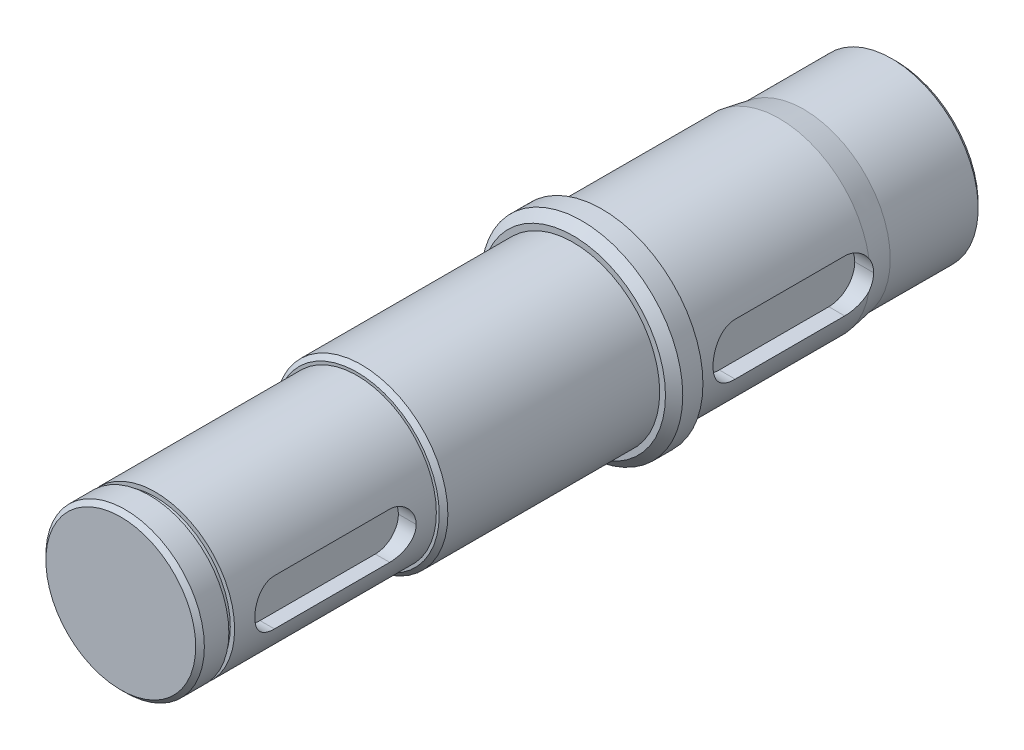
ISO-10303-21;
HEADER;
FILE_DESCRIPTION(('STEP AP214'),'2;1');
FILE_NAME('part.step','',(''),(''),'','','');
FILE_SCHEMA(('AUTOMOTIVE_DESIGN { 1 0 10303 214 1 1 1 1 }'));
ENDSEC;
DATA;
#1=APPLICATION_CONTEXT('core data for automotive mechanical design processes');
#2=APPLICATION_PROTOCOL_DEFINITION('international standard','automotive_design',2000,#1);
#3=PRODUCT_CONTEXT('',#1,'mechanical');
#4=PRODUCT('Part','Part','',(#3));
#5=PRODUCT_RELATED_PRODUCT_CATEGORY('part','',(#4));
#6=PRODUCT_DEFINITION_FORMATION('','',#4);
#7=PRODUCT_DEFINITION_CONTEXT('part definition',#1,'design');
#8=PRODUCT_DEFINITION('design','',#6,#7);
#9=PRODUCT_DEFINITION_SHAPE('','',#8);
#10=(LENGTH_UNIT() NAMED_UNIT(*) SI_UNIT(.MILLI.,.METRE.));
#11=(NAMED_UNIT(*) PLANE_ANGLE_UNIT() SI_UNIT($,.RADIAN.));
#12=(NAMED_UNIT(*) SI_UNIT($,.STERADIAN.) SOLID_ANGLE_UNIT());
#13=UNCERTAINTY_MEASURE_WITH_UNIT(LENGTH_MEASURE(1.E-05),#10,'distance_accuracy_value','');
#14=(GEOMETRIC_REPRESENTATION_CONTEXT(3) GLOBAL_UNCERTAINTY_ASSIGNED_CONTEXT((#13)) GLOBAL_UNIT_ASSIGNED_CONTEXT((#10,
#11,#12)) REPRESENTATION_CONTEXT('',''));
#15=CARTESIAN_POINT('',(0.,0.,0.));
#16=DIRECTION('',(0.,0.,1.));
#17=DIRECTION('',(1.,0.,0.));
#18=AXIS2_PLACEMENT_3D('',#15,#16,#17);
#19=CARTESIAN_POINT('',(0.,0.,23.));
#20=DIRECTION('',(0.,0.,-1.));
#21=DIRECTION('',(-1.,0.,0.));
#22=AXIS2_PLACEMENT_3D('',#19,#20,#21);
#23=CYLINDRICAL_SURFACE('',#22,30.);
#24=CARTESIAN_POINT('',(0.,0.,-7.50000000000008));
#25=DIRECTION('',(0.,0.,-1.));
#26=DIRECTION('',(-1.,0.,0.));
#27=AXIS2_PLACEMENT_3D('',#24,#25,#26);
#28=CIRCLE('',#27,30.);
#29=CARTESIAN_POINT('',(-30.,0.,-7.50000000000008));
#30=VERTEX_POINT('',#29);
#31=EDGE_CURVE('E325',#30,#30,#28,.F.);
#32=ORIENTED_EDGE('',*,*,#31,.T.);
#33=EDGE_LOOP('',(#32));
#34=FACE_BOUND('',#33,.T.);
#35=CARTESIAN_POINT('',(0.,0.,23.));
#36=DIRECTION('',(0.,0.,1.));
#37=DIRECTION('',(1.,0.,0.));
#38=AXIS2_PLACEMENT_3D('',#35,#36,#37);
#39=CIRCLE('',#38,30.);
#40=CARTESIAN_POINT('',(30.,0.,23.));
#41=VERTEX_POINT('',#40);
#42=EDGE_CURVE('E328',#41,#41,#39,.T.);
#43=ORIENTED_EDGE('',*,*,#42,.F.);
#44=EDGE_LOOP('',(#43));
#45=FACE_BOUND('',#44,.T.);
#46=ADVANCED_FACE('F35',(#34,#45),#23,.T.);
#47=CARTESIAN_POINT('',(0.,0.,93.));
#48=DIRECTION('',(0.,0.,-1.));
#49=DIRECTION('',(-1.,0.,0.));
#50=AXIS2_PLACEMENT_3D('',#47,#48,#49);
#51=CYLINDRICAL_SURFACE('',#50,31.5);
#52=CARTESIAN_POINT('',(0.,0.,31.506922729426));
#53=DIRECTION('',(0.,0.,1.));
#54=DIRECTION('',(1.,0.,0.));
#55=AXIS2_PLACEMENT_3D('',#52,#53,#54);
#56=CIRCLE('',#55,31.5);
#57=CARTESIAN_POINT('',(31.1029935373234,4.9853578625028,31.506922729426));
#58=VERTEX_POINT('',#57);
#59=CARTESIAN_POINT('',(31.1029935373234,-4.9853578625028,31.506922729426));
#60=VERTEX_POINT('',#59);
#61=EDGE_CURVE('E50',#58,#60,#56,.T.);
#62=ORIENTED_EDGE('',*,*,#61,.T.);
#63=CARTESIAN_POINT('',(31.1029935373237,-4.98535786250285,31.506922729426));
#64=CARTESIAN_POINT('',(31.068974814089,-5.19766165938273,31.6481512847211));
#65=CARTESIAN_POINT('',(31.0336953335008,-5.40379025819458,31.7983322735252));
#66=CARTESIAN_POINT('',(30.9616349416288,-5.80241445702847,32.1154696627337));
#67=CARTESIAN_POINT('',(30.9248541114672,-5.99491079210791,32.2824251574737));
#68=CARTESIAN_POINT('',(30.8507954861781,-6.36506966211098,32.6320529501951));
#69=CARTESIAN_POINT('',(30.8135175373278,-6.54272747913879,32.8147302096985));
#70=CARTESIAN_POINT('',(30.7395279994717,-6.88197308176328,33.1945477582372));
#71=CARTESIAN_POINT('',(30.7028164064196,-7.04356098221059,33.3916879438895));
#72=CARTESIAN_POINT('',(30.6309810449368,-7.34967667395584,33.7993014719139));
#73=CARTESIAN_POINT('',(30.5958584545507,-7.49419193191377,34.0097844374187));
#74=CARTESIAN_POINT('',(30.5282402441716,-7.7650530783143,34.4426796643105));
#75=CARTESIAN_POINT('',(30.495745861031,-7.89139043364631,34.665097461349));
#76=CARTESIAN_POINT('',(30.4344125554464,-8.1247200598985,35.1200255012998));
#77=CARTESIAN_POINT('',(30.405569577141,-8.23173385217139,35.3525241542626));
#78=CARTESIAN_POINT('',(30.352400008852,-8.42567086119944,35.8261220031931));
#79=CARTESIAN_POINT('',(30.3280709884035,-8.51260489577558,36.06721648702));
#80=CARTESIAN_POINT('',(30.2871855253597,-8.656866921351,36.528145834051));
#81=CARTESIAN_POINT('',(30.2700562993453,-8.71645294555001,36.7472262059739));
#82=CARTESIAN_POINT('',(30.2403547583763,-8.81894421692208,37.1895427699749));
#83=CARTESIAN_POINT('',(30.2277819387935,-8.8618513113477,37.4127784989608));
#84=CARTESIAN_POINT('',(30.2075023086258,-8.93074316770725,37.8625964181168));
#85=CARTESIAN_POINT('',(30.1998068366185,-8.95668850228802,38.0891851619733));
#86=CARTESIAN_POINT('',(30.189501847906,-8.99133079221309,38.5438461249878));
#87=CARTESIAN_POINT('',(30.1868935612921,-9.00002357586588,38.7719186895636));
#88=CARTESIAN_POINT('',(30.1869176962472,-9.,39.));
#89=B_SPLINE_CURVE_WITH_KNOTS('',3,(#63,#64,#65,#66,#67,#68,#69,#70,#71,#72,#73,#74,#75,#76,#77,
#78,#79,#80,#81,#82,#83,#84,#85,#86,#87,#88),.UNSPECIFIED.,.F.,.F.,(4,2,2,2,2,2,2,2,2,2,2,2,4),
(0.,0.771487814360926,1.54293399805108,2.31462453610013,3.08630955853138,3.8585576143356,
4.63116700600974,5.40291053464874,6.17423731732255,6.85661678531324,7.5389206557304,
8.22280494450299,8.90685457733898),.UNSPECIFIED.);
#90=CARTESIAN_POINT('',(30.1869176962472,-9.,39.));
#91=VERTEX_POINT('',#90);
#92=EDGE_CURVE('E644',#60,#91,#89,.T.);
#93=ORIENTED_EDGE('',*,*,#92,.T.);
#94=DIRECTION('',(0.,0.,-1.));
#95=VECTOR('',#94,1.);
#96=CARTESIAN_POINT('',(30.1869176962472,-9.,93.));
#97=LINE('',#96,#95);
#98=CARTESIAN_POINT('',(30.1869176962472,-9.,77.));
#99=VERTEX_POINT('',#98);
#100=EDGE_CURVE('E156',#91,#99,#97,.F.);
#101=ORIENTED_EDGE('',*,*,#100,.T.);
#102=CARTESIAN_POINT('',(30.1869176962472,-9.,77.));
#103=CARTESIAN_POINT('',(30.1868842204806,-9.00003288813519,77.2475868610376));
#104=CARTESIAN_POINT('',(30.1899625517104,-8.98978494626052,77.495161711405));
#105=CARTESIAN_POINT('',(30.2020986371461,-8.94897045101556,77.9884335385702));
#106=CARTESIAN_POINT('',(30.2111551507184,-8.91840811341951,78.234130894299));
#107=CARTESIAN_POINT('',(30.234974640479,-8.83730628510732,78.7213058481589));
#108=CARTESIAN_POINT('',(30.2497237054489,-8.78681548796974,78.9627922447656));
#109=CARTESIAN_POINT('',(30.2844699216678,-8.66630463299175,79.4404563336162));
#110=CARTESIAN_POINT('',(30.3044671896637,-8.59628414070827,79.6766339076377));
#111=CARTESIAN_POINT('',(30.3491057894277,-8.43733217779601,80.1419496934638));
#112=CARTESIAN_POINT('',(30.3737448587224,-8.34840991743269,80.3710912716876));
#113=CARTESIAN_POINT('',(30.4269683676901,-8.15229525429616,80.821038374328));
#114=CARTESIAN_POINT('',(30.4555542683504,-8.04509608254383,81.0418407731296));
#115=CARTESIAN_POINT('',(30.5158646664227,-7.81321634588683,81.4736701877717));
#116=CARTESIAN_POINT('',(30.5475897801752,-7.68853234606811,81.6846952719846));
#117=CARTESIAN_POINT('',(30.6133046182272,-7.42255617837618,82.0956423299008));
#118=CARTESIAN_POINT('',(30.6472944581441,-7.28126316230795,82.2955637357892));
#119=CARTESIAN_POINT('',(30.7175214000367,-6.97915022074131,82.6880900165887));
#120=CARTESIAN_POINT('',(30.7537938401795,-6.81792095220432,82.8803736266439));
#121=CARTESIAN_POINT('',(30.8267609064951,-6.48002163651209,83.2507731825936));
#122=CARTESIAN_POINT('',(30.8634555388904,-6.30335136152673,83.4288889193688));
#123=CARTESIAN_POINT('',(30.9362743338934,-5.93565953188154,83.7698463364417));
#124=CARTESIAN_POINT('',(30.9723983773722,-5.74463502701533,83.9326848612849));
#125=CARTESIAN_POINT('',(31.0430886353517,-5.3494792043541,84.2419625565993));
#126=CARTESIAN_POINT('',(31.0776548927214,-5.14534824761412,84.388402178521));
#127=CARTESIAN_POINT('',(31.1449329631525,-4.72124065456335,84.6665121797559));
#128=CARTESIAN_POINT('',(31.1775965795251,-4.50103541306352,84.7978459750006));
#129=CARTESIAN_POINT('',(31.2393972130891,-4.04992277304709,85.0413810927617));
#130=CARTESIAN_POINT('',(31.2685355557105,-3.81901944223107,85.1535896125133));
#131=CARTESIAN_POINT('',(31.3224530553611,-3.34813792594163,85.3579777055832));
#132=CARTESIAN_POINT('',(31.3472343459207,-3.1081642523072,85.4501670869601));
#133=CARTESIAN_POINT('',(31.3917323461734,-2.62088962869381,85.613769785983));
#134=CARTESIAN_POINT('',(31.4114503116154,-2.37359051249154,85.685188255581));
#135=CARTESIAN_POINT('',(31.4517700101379,-1.7766733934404,85.8300927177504));
#136=CARTESIAN_POINT('',(31.4697754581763,-1.42440392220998,85.893737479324));
#137=CARTESIAN_POINT('',(31.487863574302,-0.892247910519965,85.9574492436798));
#138=CARTESIAN_POINT('',(31.4924062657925,-0.714247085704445,85.9733939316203));
#139=CARTESIAN_POINT('',(31.4984765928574,-0.357516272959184,85.9946700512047));
#140=CARTESIAN_POINT('',(31.50000347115,-0.178786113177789,85.9999988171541));
#141=CARTESIAN_POINT('',(31.5,0.,86.));
#142=B_SPLINE_CURVE_WITH_KNOTS('',3,(#102,#103,#104,#105,#106,#107,#108,#109,#110,#111,#112,
#113,#114,#115,#116,#117,#118,#119,#120,#121,#122,#123,#124,#125,#126,#127,#128,#129,#130,#131,
#132,#133,#134,#135,#136,#137,#138,#139,#140,#141),.UNSPECIFIED.,.F.,.F.,(4,2,2,2,2,2,2,2,2,2,2,
2,2,2,2,2,2,2,2,4),(0.,0.742511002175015,1.48486796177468,2.2254221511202,2.96599281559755,
3.70620344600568,4.44668881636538,5.1873198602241,5.92798874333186,6.68774262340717,
7.44750771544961,8.20742939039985,8.96733014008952,9.74178486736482,10.5159475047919,
11.2897299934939,12.0633203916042,13.135490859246,13.6715176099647,14.2076789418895),.UNSPECIFIED.);
#143=CARTESIAN_POINT('',(31.5,0.,86.));
#144=VERTEX_POINT('',#143);
#145=EDGE_CURVE('E253',#99,#144,#142,.T.);
#146=ORIENTED_EDGE('',*,*,#145,.T.);
#147=CARTESIAN_POINT('',(31.5,0.,86.));
#148=CARTESIAN_POINT('',(31.5000286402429,0.247795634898,86.0000324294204));
#149=CARTESIAN_POINT('',(31.4970770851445,0.495580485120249,85.9897676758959));
#150=CARTESIAN_POINT('',(31.4854218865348,0.989284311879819,85.9488826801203));
#151=CARTESIAN_POINT('',(31.4767193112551,1.235203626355,85.918266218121));
#152=CARTESIAN_POINT('',(31.4537965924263,1.72286462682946,85.8370099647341));
#153=CARTESIAN_POINT('',(31.4395891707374,1.96461461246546,85.7864163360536));
#154=CARTESIAN_POINT('',(31.4060519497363,2.44281005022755,85.6656496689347));
#155=CARTESIAN_POINT('',(31.3867220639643,2.6792554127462,85.5954763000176));
#156=CARTESIAN_POINT('',(31.3434667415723,3.14512544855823,85.4361586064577));
#157=CARTESIAN_POINT('',(31.319543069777,3.37455277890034,85.3470215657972));
#158=CARTESIAN_POINT('',(31.2677219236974,3.82504864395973,85.1504248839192));
#159=CARTESIAN_POINT('',(31.2398229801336,4.04611404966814,85.0429584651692));
#160=CARTESIAN_POINT('',(31.1807857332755,4.47841572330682,84.8105077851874));
#161=CARTESIAN_POINT('',(31.1496469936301,4.68965066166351,84.6855211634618));
#162=CARTESIAN_POINT('',(31.084940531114,5.10096298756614,84.4189114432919));
#163=CARTESIAN_POINT('',(31.0513726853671,5.30103980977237,84.2772875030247));
#164=CARTESIAN_POINT('',(30.9818684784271,5.69336841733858,83.9748358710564));
#165=CARTESIAN_POINT('',(30.9458950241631,5.88532645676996,83.8136355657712));
#166=CARTESIAN_POINT('',(30.8732830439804,6.25506987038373,83.4758631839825));
#167=CARTESIAN_POINT('',(30.8366445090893,6.43285505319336,83.2992908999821));
#168=CARTESIAN_POINT('',(30.7636883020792,6.7731662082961,82.9318579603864));
#169=CARTESIAN_POINT('',(30.7273707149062,6.93568824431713,82.7409936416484));
#170=CARTESIAN_POINT('',(30.6560669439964,7.24435340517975,82.3462250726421));
#171=CARTESIAN_POINT('',(30.621080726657,7.3904969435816,82.1423211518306));
#172=CARTESIAN_POINT('',(30.5527210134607,7.6682543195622,81.7184109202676));
#173=CARTESIAN_POINT('',(30.5193957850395,7.7995054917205,81.4981589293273));
#174=CARTESIAN_POINT('',(30.4561658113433,8.0428708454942,81.0469631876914));
#175=CARTESIAN_POINT('',(30.4262597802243,8.15499222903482,80.8160235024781));
#176=CARTESIAN_POINT('',(30.3707910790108,8.3592018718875,80.3450792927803));
#177=CARTESIAN_POINT('',(30.3452260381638,8.45130107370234,80.1050798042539));
#178=CARTESIAN_POINT('',(30.2992352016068,8.61472719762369,79.6177410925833));
#179=CARTESIAN_POINT('',(30.2788081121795,8.68605934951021,79.3704037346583));
#180=CARTESIAN_POINT('',(30.2370339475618,8.83060560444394,78.7739998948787));
#181=CARTESIAN_POINT('',(30.2183377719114,8.89405240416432,78.4222935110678));
#182=CARTESIAN_POINT('',(30.1995414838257,8.95757243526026,77.890956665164));
#183=CARTESIAN_POINT('',(30.1948173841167,8.97347075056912,77.7132155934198));
#184=CARTESIAN_POINT('',(30.1885028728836,8.99468537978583,77.3570017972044));
#185=CARTESIAN_POINT('',(30.1869132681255,8.99999896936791,77.1785288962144));
#186=CARTESIAN_POINT('',(30.1869176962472,9.,77.));
#187=B_SPLINE_CURVE_WITH_KNOTS('',3,(#147,#148,#149,#150,#151,#152,#153,#154,#155,#156,#157,
#158,#159,#160,#161,#162,#163,#164,#165,#166,#167,#168,#169,#170,#171,#172,#173,#174,#175,#176,
#177,#178,#179,#180,#181,#182,#183,#184,#185,#186),.UNSPECIFIED.,.F.,.F.,(4,2,2,2,2,2,2,2,2,2,2,
2,2,2,2,2,2,2,2,4),(0.,0.743140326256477,1.4861426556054,2.22743802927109,2.96874591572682,
3.70976957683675,4.45106783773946,5.19246606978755,5.93390183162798,6.69273400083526,
7.45157641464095,8.21061399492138,8.96963240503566,9.74433591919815,10.5187471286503,
11.292734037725,12.0665258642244,13.1370383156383,13.6722900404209,14.207679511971),.UNSPECIFIED.);
#188=CARTESIAN_POINT('',(30.1869176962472,9.,77.));
#189=VERTEX_POINT('',#188);
#190=EDGE_CURVE('E259',#144,#189,#187,.T.);
#191=ORIENTED_EDGE('',*,*,#190,.T.);
#192=DIRECTION('',(0.,0.,-1.));
#193=VECTOR('',#192,1.);
#194=CARTESIAN_POINT('',(30.1869176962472,9.,93.));
#195=LINE('',#194,#193);
#196=CARTESIAN_POINT('',(30.1869176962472,9.,39.));
#197=VERTEX_POINT('',#196);
#198=EDGE_CURVE('E162',#197,#189,#195,.F.);
#199=ORIENTED_EDGE('',*,*,#198,.F.);
#200=CARTESIAN_POINT('',(30.1869176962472,9.,39.));
#201=CARTESIAN_POINT('',(30.1868841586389,9.00003295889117,38.7523094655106));
#202=CARTESIAN_POINT('',(30.1899650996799,8.98977639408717,38.5046308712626));
#203=CARTESIAN_POINT('',(30.2021113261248,8.9489277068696,38.0111537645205));
#204=CARTESIAN_POINT('',(30.2111753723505,8.9183397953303,37.7653548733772));
#205=CARTESIAN_POINT('',(30.2350044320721,8.83720434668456,37.2781856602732));
#206=CARTESIAN_POINT('',(30.2497507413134,8.78672228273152,37.0368035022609));
#207=CARTESIAN_POINT('',(30.2844867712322,8.6662456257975,36.5593446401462));
#208=CARTESIAN_POINT('',(30.3044765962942,8.59625064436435,36.3232680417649));
#209=CARTESIAN_POINT('',(30.3491002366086,8.43735195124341,35.8581081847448));
#210=CARTESIAN_POINT('',(30.3737325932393,8.34845417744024,35.6290227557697));
#211=CARTESIAN_POINT('',(30.426943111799,8.1523892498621,35.1791648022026));
#212=CARTESIAN_POINT('',(30.4555230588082,8.04521382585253,34.9583960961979));
#213=CARTESIAN_POINT('',(30.5158324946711,7.81334228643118,34.5265467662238));
#214=CARTESIAN_POINT('',(30.5475638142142,7.68863596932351,34.3154718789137));
#215=CARTESIAN_POINT('',(30.6132915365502,7.42261059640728,33.9044347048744));
#216=CARTESIAN_POINT('',(30.6472879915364,7.28129115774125,33.7044726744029));
#217=CARTESIAN_POINT('',(30.71681749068,6.98217822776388,33.3158441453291));
#218=CARTESIAN_POINT('',(30.7523576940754,6.82430177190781,33.1272427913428));
#219=CARTESIAN_POINT('',(30.8238631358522,6.49369463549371,32.7636295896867));
#220=CARTESIAN_POINT('',(30.8598283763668,6.32096388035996,32.5886178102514));
#221=CARTESIAN_POINT('',(30.9312384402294,5.96170934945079,32.2532691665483));
#222=CARTESIAN_POINT('',(30.9666832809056,5.77518603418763,32.0929318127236));
#223=CARTESIAN_POINT('',(31.0361413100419,5.38947888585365,31.787923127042));
#224=CARTESIAN_POINT('',(31.0701544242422,5.1902943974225,31.6432526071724));
#225=CARTESIAN_POINT('',(31.1029935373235,4.98535786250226,31.5069227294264));
#226=B_SPLINE_CURVE_WITH_KNOTS('',3,(#200,#201,#202,#203,#204,#205,#206,#207,#208,#209,#210,
#211,#212,#213,#214,#215,#216,#217,#218,#219,#220,#221,#222,#223,#224,#225),.UNSPECIFIED.,.F.,
.F.,(4,2,2,2,2,2,2,2,2,2,2,2,4),(0.,0.74282188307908,1.48548996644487,2.22573401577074,
2.96599280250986,3.70601939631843,4.44638172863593,5.18717669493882,5.92798873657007,
6.67270837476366,7.41743175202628,8.16213027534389,8.906867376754),.UNSPECIFIED.);
#227=EDGE_CURVE('E286',#197,#58,#226,.T.);
#228=ORIENTED_EDGE('',*,*,#227,.T.);
#229=EDGE_LOOP('',(#62,#93,#101,#146,#191,#199,#228));
#230=FACE_BOUND('',#229,.T.);
#231=CARTESIAN_POINT('',(0.,0.,93.));
#232=DIRECTION('',(0.,0.,1.));
#233=DIRECTION('',(1.,0.,0.));
#234=AXIS2_PLACEMENT_3D('',#231,#232,#233);
#235=CIRCLE('',#234,31.5);
#236=CARTESIAN_POINT('',(31.5,0.,93.));
#237=VERTEX_POINT('',#236);
#238=EDGE_CURVE('E330',#237,#237,#235,.T.);
#239=ORIENTED_EDGE('',*,*,#238,.F.);
#240=EDGE_LOOP('',(#239));
#241=FACE_BOUND('',#240,.T.);
#242=ADVANCED_FACE('F265',(#230,#241),#51,.T.);
#243=CARTESIAN_POINT('',(0.,0.,103.));
#244=DIRECTION('',(0.,0.,-1.));
#245=DIRECTION('',(-1.,0.,0.));
#246=AXIS2_PLACEMENT_3D('',#243,#244,#245);
#247=CYLINDRICAL_SURFACE('',#246,35.);
#248=CARTESIAN_POINT('',(0.,0.,100.));
#249=DIRECTION('',(0.,0.,1.));
#250=DIRECTION('',(1.,0.,0.));
#251=AXIS2_PLACEMENT_3D('',#248,#249,#250);
#252=CIRCLE('',#251,35.);
#253=CARTESIAN_POINT('',(35.,0.,100.));
#254=VERTEX_POINT('',#253);
#255=EDGE_CURVE('E341',#254,#254,#252,.F.);
#256=ORIENTED_EDGE('',*,*,#255,.T.);
#257=EDGE_LOOP('',(#256));
#258=FACE_BOUND('',#257,.T.);
#259=CARTESIAN_POINT('',(0.,0.,93.));
#260=DIRECTION('',(0.,0.,1.));
#261=DIRECTION('',(1.,0.,0.));
#262=AXIS2_PLACEMENT_3D('',#259,#260,#261);
#263=CIRCLE('',#262,35.);
#264=CARTESIAN_POINT('',(35.,0.,93.));
#265=VERTEX_POINT('',#264);
#266=EDGE_CURVE('E335',#265,#265,#263,.T.);
#267=ORIENTED_EDGE('',*,*,#266,.T.);
#268=EDGE_LOOP('',(#267));
#269=FACE_BOUND('',#268,.T.);
#270=ADVANCED_FACE('F321',(#258,#269),#247,.T.);
#271=CARTESIAN_POINT('',(0.,0.,103.));
#272=DIRECTION('',(0.,0.,1.));
#273=DIRECTION('',(1.,0.,0.));
#274=AXIS2_PLACEMENT_3D('',#271,#272,#273);
#275=PLANE('',#274);
#276=CARTESIAN_POINT('',(0.,0.,103.));
#277=DIRECTION('',(0.,0.,1.));
#278=DIRECTION('',(1.,0.,0.));
#279=AXIS2_PLACEMENT_3D('',#276,#277,#278);
#280=CIRCLE('',#279,32.);
#281=CARTESIAN_POINT('',(32.,0.,103.));
#282=VERTEX_POINT('',#281);
#283=EDGE_CURVE('E332',#282,#282,#280,.T.);
#284=ORIENTED_EDGE('',*,*,#283,.T.);
#285=EDGE_LOOP('',(#284));
#286=FACE_BOUND('',#285,.T.);
#287=CARTESIAN_POINT('',(0.,0.,103.));
#288=DIRECTION('',(0.,0.,1.));
#289=DIRECTION('',(1.,0.,0.));
#290=AXIS2_PLACEMENT_3D('',#287,#288,#289);
#291=CIRCLE('',#290,30.);
#292=CARTESIAN_POINT('',(30.,0.,103.));
#293=VERTEX_POINT('',#292);
#294=EDGE_CURVE('E386',#293,#293,#291,.T.);
#295=ORIENTED_EDGE('',*,*,#294,.F.);
#296=EDGE_LOOP('',(#295));
#297=FACE_BOUND('',#296,.T.);
#298=ADVANCED_FACE('F399',(#286,#297),#275,.T.);
#299=CARTESIAN_POINT('',(0.,0.,93.));
#300=DIRECTION('',(0.,0.,1.));
#301=DIRECTION('',(1.,0.,0.));
#302=AXIS2_PLACEMENT_3D('',#299,#300,#301);
#303=PLANE('',#302);
#304=ORIENTED_EDGE('',*,*,#238,.T.);
#305=EDGE_LOOP('',(#304));
#306=FACE_BOUND('',#305,.T.);
#307=ORIENTED_EDGE('',*,*,#266,.F.);
#308=EDGE_LOOP('',(#307));
#309=FACE_BOUND('',#308,.T.);
#310=ADVANCED_FACE('F396',(#306,#309),#303,.F.);
#311=CARTESIAN_POINT('',(0.,0.,168.));
#312=DIRECTION('',(0.,0.,-1.));
#313=DIRECTION('',(-1.,0.,0.));
#314=AXIS2_PLACEMENT_3D('',#311,#312,#313);
#315=CYLINDRICAL_SURFACE('',#314,30.);
#316=CARTESIAN_POINT('',(0.,0.,176.5));
#317=DIRECTION('',(0.,0.,1.));
#318=DIRECTION('',(1.,0.,0.));
#319=AXIS2_PLACEMENT_3D('',#316,#317,#318);
#320=CIRCLE('',#319,30.);
#321=CARTESIAN_POINT('',(30.,0.,176.5));
#322=VERTEX_POINT('',#321);
#323=EDGE_CURVE('E347',#322,#322,#320,.F.);
#324=ORIENTED_EDGE('',*,*,#323,.T.);
#325=EDGE_LOOP('',(#324));
#326=FACE_BOUND('',#325,.T.);
#327=ORIENTED_EDGE('',*,*,#294,.T.);
#328=EDGE_LOOP('',(#327));
#329=FACE_BOUND('',#328,.T.);
#330=ADVANCED_FACE('F398',(#326,#329),#315,.T.);
#331=CARTESIAN_POINT('',(0.,0.,178.));
#332=DIRECTION('',(0.,0.,1.));
#333=DIRECTION('',(1.,0.,0.));
#334=AXIS2_PLACEMENT_3D('',#331,#332,#333);
#335=PLANE('',#334);
#336=CARTESIAN_POINT('',(0.,0.,178.));
#337=DIRECTION('',(0.,0.,1.));
#338=DIRECTION('',(1.,0.,0.));
#339=AXIS2_PLACEMENT_3D('',#336,#337,#338);
#340=CIRCLE('',#339,28.5);
#341=CARTESIAN_POINT('',(28.5,0.,178.));
#342=VERTEX_POINT('',#341);
#343=EDGE_CURVE('E344',#342,#342,#340,.T.);
#344=ORIENTED_EDGE('',*,*,#343,.T.);
#345=EDGE_LOOP('',(#344));
#346=FACE_BOUND('',#345,.T.);
#347=CARTESIAN_POINT('',(0.,0.,178.));
#348=DIRECTION('',(0.,0.,1.));
#349=DIRECTION('',(1.,0.,0.));
#350=AXIS2_PLACEMENT_3D('',#347,#348,#349);
#351=CIRCLE('',#350,27.5);
#352=CARTESIAN_POINT('',(27.5,0.,178.));
#353=VERTEX_POINT('',#352);
#354=EDGE_CURVE('E159',#353,#353,#351,.T.);
#355=ORIENTED_EDGE('',*,*,#354,.F.);
#356=EDGE_LOOP('',(#355));
#357=FACE_BOUND('',#356,.T.);
#358=ADVANCED_FACE('F379',(#346,#357),#335,.T.);
#359=CARTESIAN_POINT('',(0.,0.,248.));
#360=DIRECTION('',(0.,0.,-1.));
#361=DIRECTION('',(-1.,0.,0.));
#362=AXIS2_PLACEMENT_3D('',#359,#360,#361);
#363=CYLINDRICAL_SURFACE('',#362,27.5);
#364=DIRECTION('',(0.,0.,-1.));
#365=VECTOR('',#364,1.);
#366=CARTESIAN_POINT('',(26.3106442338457,8.00000000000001,248.));
#367=LINE('',#366,#365);
#368=CARTESIAN_POINT('',(26.3106442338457,8.00000000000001,193.));
#369=VERTEX_POINT('',#368);
#370=CARTESIAN_POINT('',(26.3106442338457,8.00000000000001,233.));
#371=VERTEX_POINT('',#370);
#372=EDGE_CURVE('E349',#369,#371,#367,.F.);
#373=ORIENTED_EDGE('',*,*,#372,.F.);
#374=CARTESIAN_POINT('',(26.3106442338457,8.00000000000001,193.));
#375=CARTESIAN_POINT('',(26.3106138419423,8.00002941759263,192.780106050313));
#376=CARTESIAN_POINT('',(26.3133998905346,7.99093508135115,192.560223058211));
#377=CARTESIAN_POINT('',(26.324383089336,7.95471645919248,192.1221286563));
#378=CARTESIAN_POINT('',(26.3325790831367,7.92759602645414,191.903916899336));
#379=CARTESIAN_POINT('',(26.354133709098,7.85563227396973,191.471258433));
#380=CARTESIAN_POINT('',(26.3674794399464,7.81083323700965,191.256803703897));
#381=CARTESIAN_POINT('',(26.3989177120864,7.70391238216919,190.832612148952));
#382=CARTESIAN_POINT('',(26.4170103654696,7.64179015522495,190.622875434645));
#383=CARTESIAN_POINT('',(26.4573943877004,7.50077640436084,190.209661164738));
#384=CARTESIAN_POINT('',(26.4796835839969,7.42189355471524,190.00618043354));
#385=CARTESIAN_POINT('',(26.5278284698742,7.24792804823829,189.60661875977));
#386=CARTESIAN_POINT('',(26.5536854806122,7.15283938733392,189.410540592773));
#387=CARTESIAN_POINT('',(26.6082369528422,6.9471607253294,189.02705259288));
#388=CARTESIAN_POINT('',(26.6369320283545,6.83656736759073,188.839644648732));
#389=CARTESIAN_POINT('',(26.6963696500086,6.60065452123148,188.474673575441));
#390=CARTESIAN_POINT('',(26.7271123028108,6.47533426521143,188.297110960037));
#391=CARTESIAN_POINT('',(26.790661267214,6.20724926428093,187.948294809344));
#392=CARTESIAN_POINT('',(26.8235007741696,6.06410779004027,187.77733675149));
#393=CARTESIAN_POINT('',(26.8895650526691,5.76410253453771,187.447996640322));
#394=CARTESIAN_POINT('',(26.9227898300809,5.60723854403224,187.289614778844));
#395=CARTESIAN_POINT('',(26.9887272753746,5.28075132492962,186.986406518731));
#396=CARTESIAN_POINT('',(27.0214398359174,5.11112546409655,186.841582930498));
#397=CARTESIAN_POINT('',(27.0854603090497,4.76021470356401,186.566489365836));
#398=CARTESIAN_POINT('',(27.1167682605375,4.57893012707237,186.436218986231));
#399=CARTESIAN_POINT('',(27.1777351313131,4.2021242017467,186.188688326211));
#400=CARTESIAN_POINT('',(27.2073488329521,4.00639132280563,186.071738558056));
#401=CARTESIAN_POINT('',(27.2633861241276,3.60537806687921,185.854847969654));
#402=CARTESIAN_POINT('',(27.289810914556,3.40010132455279,185.754900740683));
#403=CARTESIAN_POINT('',(27.3387149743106,2.98144701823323,185.572817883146));
#404=CARTESIAN_POINT('',(27.361196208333,2.76807355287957,185.490673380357));
#405=CARTESIAN_POINT('',(27.4015730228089,2.33477918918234,185.344865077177));
#406=CARTESIAN_POINT('',(27.4194697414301,2.11485993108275,185.28119668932));
#407=CARTESIAN_POINT('',(27.4561180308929,1.58341141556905,185.151831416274));
#408=CARTESIAN_POINT('',(27.4724993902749,1.26949144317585,185.094960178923));
#409=CARTESIAN_POINT('',(27.488956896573,0.795233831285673,185.038026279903));
#410=CARTESIAN_POINT('',(27.4930903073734,0.636590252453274,185.023777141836));
#411=CARTESIAN_POINT('',(27.4986137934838,0.31864798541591,185.004763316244));
#412=CARTESIAN_POINT('',(27.5000031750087,0.159349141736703,185.000001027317));
#413=CARTESIAN_POINT('',(27.5,0.,185.));
#414=B_SPLINE_CURVE_WITH_KNOTS('',3,(#374,#375,#376,#377,#378,#379,#380,#381,#382,#383,#384,
#385,#386,#387,#388,#389,#390,#391,#392,#393,#394,#395,#396,#397,#398,#399,#400,#401,#402,#403,
#404,#405,#406,#407,#408,#409,#410,#411,#412,#413),.UNSPECIFIED.,.F.,.F.,(4,2,2,2,2,2,2,2,2,2,2,
2,2,2,2,2,2,2,2,4),(0.,0.659459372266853,1.31877782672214,1.97645514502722,2.6341479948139,
3.29150128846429,3.94909865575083,4.60683860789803,5.26461284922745,5.93996808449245,
6.61533361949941,7.29083883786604,7.96632533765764,8.65525486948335,9.3439241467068,
10.032249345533,10.7204034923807,11.6759650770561,12.1537146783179,12.6315850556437),.UNSPECIFIED.);
#415=CARTESIAN_POINT('',(27.5,0.,185.));
#416=VERTEX_POINT('',#415);
#417=EDGE_CURVE('E189',#369,#416,#414,.T.);
#418=ORIENTED_EDGE('',*,*,#417,.T.);
#419=CARTESIAN_POINT('',(27.5,0.,185.));
#420=CARTESIAN_POINT('',(27.5000258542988,-0.220093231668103,184.999971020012));
#421=CARTESIAN_POINT('',(27.4973586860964,-0.44017667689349,185.009081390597));
#422=CARTESIAN_POINT('',(27.4868263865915,-0.878683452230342,185.04536725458));
#423=CARTESIAN_POINT('',(27.4789622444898,-1.09710709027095,185.072539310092));
#424=CARTESIAN_POINT('',(27.4582482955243,-1.53022955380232,185.144650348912));
#425=CARTESIAN_POINT('',(27.4454102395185,-1.74493592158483,185.189547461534));
#426=CARTESIAN_POINT('',(27.4151050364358,-2.16963476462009,185.296712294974));
#427=CARTESIAN_POINT('',(27.3976378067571,-2.37962715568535,185.358980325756));
#428=CARTESIAN_POINT('',(27.3585499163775,-2.79337062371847,185.50034287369));
#429=CARTESIAN_POINT('',(27.3369309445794,-2.9971241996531,185.579430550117));
#430=CARTESIAN_POINT('',(27.2900998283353,-3.3972099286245,185.753855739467));
#431=CARTESIAN_POINT('',(27.2648863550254,-3.5935393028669,185.849199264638));
#432=CARTESIAN_POINT('',(27.2115277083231,-3.97747851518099,186.055422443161));
#433=CARTESIAN_POINT('',(27.183382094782,-4.16508703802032,186.166304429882));
#434=CARTESIAN_POINT('',(27.1248896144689,-4.53040742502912,186.402821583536));
#435=CARTESIAN_POINT('',(27.0945426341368,-4.70811877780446,186.528457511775));
#436=CARTESIAN_POINT('',(27.0316747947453,-5.0567470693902,186.796866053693));
#437=CARTESIAN_POINT('',(26.9991190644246,-5.22739472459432,186.939980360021));
#438=CARTESIAN_POINT('',(26.9333947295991,-5.55610915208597,187.239865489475));
#439=CARTESIAN_POINT('',(26.9002261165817,-5.71417574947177,187.396636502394));
#440=CARTESIAN_POINT('',(26.8341666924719,-6.01676749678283,187.722877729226));
#441=CARTESIAN_POINT('',(26.8012759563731,-6.16128909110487,187.892351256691));
#442=CARTESIAN_POINT('',(26.7366862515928,-6.43579797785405,188.24289343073));
#443=CARTESIAN_POINT('',(26.7049872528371,-6.56578563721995,188.423961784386));
#444=CARTESIAN_POINT('',(26.6430087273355,-6.81297860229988,188.800578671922));
#445=CARTESIAN_POINT('',(26.6127744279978,-6.92984863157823,188.996354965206));
#446=CARTESIAN_POINT('',(26.5553953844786,-7.1465755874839,189.397444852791));
#447=CARTESIAN_POINT('',(26.5282494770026,-7.24643892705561,189.602754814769));
#448=CARTESIAN_POINT('',(26.477887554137,-7.42835023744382,190.021465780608));
#449=CARTESIAN_POINT('',(26.4546693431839,-7.51040816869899,190.234862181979));
#450=CARTESIAN_POINT('',(26.4128880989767,-7.6560472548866,190.668214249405));
#451=CARTESIAN_POINT('',(26.3943238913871,-7.71963307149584,190.888168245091));
#452=CARTESIAN_POINT('',(26.3563055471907,-7.84865687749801,191.419127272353));
#453=CARTESIAN_POINT('',(26.3392728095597,-7.90533957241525,191.732512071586));
#454=CARTESIAN_POINT('',(26.3221472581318,-7.96209093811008,192.205991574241));
#455=CARTESIAN_POINT('',(26.3178426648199,-7.97629594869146,192.36438859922));
#456=CARTESIAN_POINT('',(26.3120887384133,-7.99525126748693,192.681840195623));
#457=CARTESIAN_POINT('',(26.3106401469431,-7.99999911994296,192.840894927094));
#458=CARTESIAN_POINT('',(26.3106442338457,-8.,193.));
#459=B_SPLINE_CURVE_WITH_KNOTS('',3,(#419,#420,#421,#422,#423,#424,#425,#426,#427,#428,#429,
#430,#431,#432,#433,#434,#435,#436,#437,#438,#439,#440,#441,#442,#443,#444,#445,#446,#447,#448,
#449,#450,#451,#452,#453,#454,#455,#456,#457,#458),.UNSPECIFIED.,.F.,.F.,(4,2,2,2,2,2,2,2,2,2,2,
2,2,2,2,2,2,2,2,4),(0.,0.660060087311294,1.31999457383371,1.97837938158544,2.63677593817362,
3.29490522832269,3.95327845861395,4.61175066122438,5.27025685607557,5.94473241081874,
6.61921734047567,7.29387883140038,7.96852328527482,8.65768614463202,9.34658855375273,
10.0351045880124,10.7234467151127,11.6774335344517,12.154447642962,12.6315856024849),.UNSPECIFIED.);
#460=CARTESIAN_POINT('',(26.3106442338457,-8.,193.));
#461=VERTEX_POINT('',#460);
#462=EDGE_CURVE('E182',#416,#461,#459,.T.);
#463=ORIENTED_EDGE('',*,*,#462,.T.);
#464=DIRECTION('',(0.,0.,-1.));
#465=VECTOR('',#464,1.);
#466=CARTESIAN_POINT('',(26.3106442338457,-8.,248.));
#467=LINE('',#466,#465);
#468=CARTESIAN_POINT('',(26.3106442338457,-8.,233.));
#469=VERTEX_POINT('',#468);
#470=EDGE_CURVE('E148',#461,#469,#467,.F.);
#471=ORIENTED_EDGE('',*,*,#470,.T.);
#472=CARTESIAN_POINT('',(26.3106442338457,-8.,233.));
#473=CARTESIAN_POINT('',(26.3106138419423,-8.00002941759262,233.219893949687));
#474=CARTESIAN_POINT('',(26.3133998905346,-7.99093508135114,233.439776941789));
#475=CARTESIAN_POINT('',(26.324383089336,-7.95471645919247,233.8778713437));
#476=CARTESIAN_POINT('',(26.3325790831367,-7.92759602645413,234.096083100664));
#477=CARTESIAN_POINT('',(26.354133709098,-7.85563227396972,234.528741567));
#478=CARTESIAN_POINT('',(26.3674794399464,-7.81083323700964,234.743196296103));
#479=CARTESIAN_POINT('',(26.3989177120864,-7.70391238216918,235.167387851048));
#480=CARTESIAN_POINT('',(26.4170103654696,-7.64179015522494,235.377124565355));
#481=CARTESIAN_POINT('',(26.4573943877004,-7.50077640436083,235.790338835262));
#482=CARTESIAN_POINT('',(26.4796835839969,-7.42189355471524,235.99381956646));
#483=CARTESIAN_POINT('',(26.5278284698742,-7.24792804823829,236.39338124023));
#484=CARTESIAN_POINT('',(26.5536854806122,-7.15283938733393,236.589459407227));
#485=CARTESIAN_POINT('',(26.6082369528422,-6.94716072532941,236.97294740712));
#486=CARTESIAN_POINT('',(26.6369320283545,-6.83656736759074,237.160355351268));
#487=CARTESIAN_POINT('',(26.6963696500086,-6.60065452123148,237.525326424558));
#488=CARTESIAN_POINT('',(26.7271123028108,-6.47533426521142,237.702889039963));
#489=CARTESIAN_POINT('',(26.790661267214,-6.20724926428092,238.051705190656));
#490=CARTESIAN_POINT('',(26.8235007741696,-6.06410779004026,238.22266324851));
#491=CARTESIAN_POINT('',(26.8895650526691,-5.76410253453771,238.552003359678));
#492=CARTESIAN_POINT('',(26.9227898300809,-5.60723854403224,238.710385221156));
#493=CARTESIAN_POINT('',(26.9887272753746,-5.28075132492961,239.013593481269));
#494=CARTESIAN_POINT('',(27.0214398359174,-5.11112546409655,239.158417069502));
#495=CARTESIAN_POINT('',(27.0854603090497,-4.760214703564,239.433510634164));
#496=CARTESIAN_POINT('',(27.1167682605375,-4.57893012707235,239.563781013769));
#497=CARTESIAN_POINT('',(27.1777351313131,-4.20212420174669,239.811311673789));
#498=CARTESIAN_POINT('',(27.2073488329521,-4.00639132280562,239.928261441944));
#499=CARTESIAN_POINT('',(27.2633861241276,-3.60537806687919,240.145152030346));
#500=CARTESIAN_POINT('',(27.289810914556,-3.40010132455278,240.245099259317));
#501=CARTESIAN_POINT('',(27.3387149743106,-2.98144701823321,240.427182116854));
#502=CARTESIAN_POINT('',(27.361196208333,-2.76807355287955,240.509326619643));
#503=CARTESIAN_POINT('',(27.4015730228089,-2.33477918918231,240.655134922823));
#504=CARTESIAN_POINT('',(27.4194697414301,-2.11485993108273,240.71880331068));
#505=CARTESIAN_POINT('',(27.4561180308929,-1.58341141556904,240.848168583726));
#506=CARTESIAN_POINT('',(27.4724993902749,-1.26949144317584,240.905039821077));
#507=CARTESIAN_POINT('',(27.488956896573,-0.795233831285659,240.961973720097));
#508=CARTESIAN_POINT('',(27.4930903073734,-0.63659025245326,240.976222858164));
#509=CARTESIAN_POINT('',(27.4986137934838,-0.318647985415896,240.995236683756));
#510=CARTESIAN_POINT('',(27.5000031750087,-0.159349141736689,240.999998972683));
#511=CARTESIAN_POINT('',(27.5,0.,241.));
#512=B_SPLINE_CURVE_WITH_KNOTS('',3,(#472,#473,#474,#475,#476,#477,#478,#479,#480,#481,#482,
#483,#484,#485,#486,#487,#488,#489,#490,#491,#492,#493,#494,#495,#496,#497,#498,#499,#500,#501,
#502,#503,#504,#505,#506,#507,#508,#509,#510,#511),.UNSPECIFIED.,.F.,.F.,(4,2,2,2,2,2,2,2,2,2,2,
2,2,2,2,2,2,2,2,4),(0.,0.659459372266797,1.31877782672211,1.97645514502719,2.6341479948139,
3.29150128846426,3.94909865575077,4.60683860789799,5.26461284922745,5.93996808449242,
6.61533361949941,7.29083883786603,7.96632533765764,8.65525486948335,9.3439241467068,
10.032249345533,10.7204034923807,11.6759650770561,12.1537146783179,12.6315850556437),.UNSPECIFIED.);
#513=CARTESIAN_POINT('',(27.5,0.,241.));
#514=VERTEX_POINT('',#513);
#515=EDGE_CURVE('E219',#469,#514,#512,.T.);
#516=ORIENTED_EDGE('',*,*,#515,.T.);
#517=CARTESIAN_POINT('',(27.5,0.,241.));
#518=CARTESIAN_POINT('',(27.5000258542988,0.220093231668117,241.000028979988));
#519=CARTESIAN_POINT('',(27.4973586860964,0.440176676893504,240.990918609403));
#520=CARTESIAN_POINT('',(27.4868263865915,0.878683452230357,240.95463274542));
#521=CARTESIAN_POINT('',(27.4789622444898,1.09710709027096,240.927460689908));
#522=CARTESIAN_POINT('',(27.4582482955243,1.53022955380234,240.855349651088));
#523=CARTESIAN_POINT('',(27.4454102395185,1.74493592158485,240.810452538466));
#524=CARTESIAN_POINT('',(27.4151050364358,2.16963476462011,240.703287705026));
#525=CARTESIAN_POINT('',(27.3976378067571,2.37962715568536,240.641019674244));
#526=CARTESIAN_POINT('',(27.3585499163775,2.79337062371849,240.49965712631));
#527=CARTESIAN_POINT('',(27.3369309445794,2.99712419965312,240.420569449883));
#528=CARTESIAN_POINT('',(27.2900998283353,3.39720992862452,240.246144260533));
#529=CARTESIAN_POINT('',(27.2648863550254,3.59353930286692,240.150800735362));
#530=CARTESIAN_POINT('',(27.211527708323,3.97747851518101,239.944577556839));
#531=CARTESIAN_POINT('',(27.183382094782,4.16508703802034,239.833695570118));
#532=CARTESIAN_POINT('',(27.1248896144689,4.53040742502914,239.597178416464));
#533=CARTESIAN_POINT('',(27.0945426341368,4.70811877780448,239.471542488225));
#534=CARTESIAN_POINT('',(27.0316747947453,5.05674706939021,239.203133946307));
#535=CARTESIAN_POINT('',(26.9991190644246,5.22739472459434,239.060019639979));
#536=CARTESIAN_POINT('',(26.9333947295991,5.55610915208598,238.760134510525));
#537=CARTESIAN_POINT('',(26.9002261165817,5.71417574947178,238.603363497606));
#538=CARTESIAN_POINT('',(26.8341666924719,6.01676749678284,238.277122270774));
#539=CARTESIAN_POINT('',(26.8012759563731,6.16128909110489,238.107648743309));
#540=CARTESIAN_POINT('',(26.7366862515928,6.43579797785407,237.75710656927));
#541=CARTESIAN_POINT('',(26.7049872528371,6.56578563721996,237.576038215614));
#542=CARTESIAN_POINT('',(26.6430087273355,6.81297860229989,237.199421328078));
#543=CARTESIAN_POINT('',(26.6127744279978,6.92984863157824,237.003645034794));
#544=CARTESIAN_POINT('',(26.5553953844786,7.14657558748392,236.602555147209));
#545=CARTESIAN_POINT('',(26.5282494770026,7.24643892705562,236.397245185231));
#546=CARTESIAN_POINT('',(26.477887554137,7.42835023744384,235.978534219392));
#547=CARTESIAN_POINT('',(26.4546693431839,7.510408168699,235.765137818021));
#548=CARTESIAN_POINT('',(26.4128880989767,7.65604725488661,235.331785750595));
#549=CARTESIAN_POINT('',(26.3943238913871,7.71963307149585,235.111831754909));
#550=CARTESIAN_POINT('',(26.3563055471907,7.84865687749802,234.580872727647));
#551=CARTESIAN_POINT('',(26.3392728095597,7.90533957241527,234.267487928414));
#552=CARTESIAN_POINT('',(26.3221472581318,7.96209093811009,233.794008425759));
#553=CARTESIAN_POINT('',(26.3178426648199,7.97629594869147,233.63561140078));
#554=CARTESIAN_POINT('',(26.3120887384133,7.99525126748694,233.318159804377));
#555=CARTESIAN_POINT('',(26.3106401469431,7.99999911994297,233.159105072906));
#556=CARTESIAN_POINT('',(26.3106442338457,8.00000000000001,233.));
#557=B_SPLINE_CURVE_WITH_KNOTS('',3,(#517,#518,#519,#520,#521,#522,#523,#524,#525,#526,#527,
#528,#529,#530,#531,#532,#533,#534,#535,#536,#537,#538,#539,#540,#541,#542,#543,#544,#545,#546,
#547,#548,#549,#550,#551,#552,#553,#554,#555,#556),.UNSPECIFIED.,.F.,.F.,(4,2,2,2,2,2,2,2,2,2,2,
2,2,2,2,2,2,2,2,4),(0.,0.660060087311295,1.31999457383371,1.97837938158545,2.63677593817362,
3.29490522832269,3.95327845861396,4.61175066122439,5.27025685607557,5.94473241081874,
6.61921734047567,7.29387883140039,7.96852328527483,8.65768614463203,9.34658855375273,
10.0351045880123,10.7234467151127,11.6774335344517,12.154447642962,12.6315856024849),.UNSPECIFIED.);
#558=EDGE_CURVE('E224',#514,#371,#557,.T.);
#559=ORIENTED_EDGE('',*,*,#558,.T.);
#560=EDGE_LOOP('',(#373,#418,#463,#471,#516,#559));
#561=FACE_BOUND('',#560,.T.);
#562=CARTESIAN_POINT('',(0.,0.,248.));
#563=DIRECTION('',(0.,0.,1.));
#564=DIRECTION('',(1.,0.,0.));
#565=AXIS2_PLACEMENT_3D('',#562,#563,#564);
#566=CIRCLE('',#565,27.5);
#567=CARTESIAN_POINT('',(27.5,0.,248.));
#568=VERTEX_POINT('',#567);
#569=EDGE_CURVE('E173',#568,#568,#566,.T.);
#570=ORIENTED_EDGE('',*,*,#569,.F.);
#571=EDGE_LOOP('',(#570));
#572=FACE_BOUND('',#571,.T.);
#573=ORIENTED_EDGE('',*,*,#354,.T.);
#574=EDGE_LOOP('',(#573));
#575=FACE_BOUND('',#574,.T.);
#576=ADVANCED_FACE('F195',(#561,#572,#575),#363,.T.);
#577=CARTESIAN_POINT('',(0.,0.,248.));
#578=DIRECTION('',(0.,0.,1.));
#579=DIRECTION('',(1.,0.,0.));
#580=AXIS2_PLACEMENT_3D('',#577,#578,#579);
#581=PLANE('',#580);
#582=CARTESIAN_POINT('',(0.,0.,248.));
#583=DIRECTION('',(0.,0.,1.));
#584=DIRECTION('',(1.,0.,0.));
#585=AXIS2_PLACEMENT_3D('',#582,#583,#584);
#586=CIRCLE('',#585,26.);
#587=CARTESIAN_POINT('',(26.,0.,248.));
#588=VERTEX_POINT('',#587);
#589=EDGE_CURVE('E383',#588,#588,#586,.T.);
#590=ORIENTED_EDGE('',*,*,#589,.F.);
#591=EDGE_LOOP('',(#590));
#592=FACE_BOUND('',#591,.T.);
#593=ORIENTED_EDGE('',*,*,#569,.T.);
#594=EDGE_LOOP('',(#593));
#595=FACE_BOUND('',#594,.T.);
#596=ADVANCED_FACE('F306',(#592,#595),#581,.T.);
#597=CARTESIAN_POINT('',(0.,0.,31.506922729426));
#598=DIRECTION('',(0.,0.,1.));
#599=DIRECTION('',(1.,0.,0.));
#600=AXIS2_PLACEMENT_3D('',#597,#598,#599);
#601=CONICAL_SURFACE('',#600,31.5,0.174532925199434);
#602=CARTESIAN_POINT('',(31.1029935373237,4.98535786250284,31.506922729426));
#603=CARTESIAN_POINT('',(31.1118329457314,4.77256157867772,31.3653131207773));
#604=CARTESIAN_POINT('',(31.1210735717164,4.55372344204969,31.2328226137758));
#605=CARTESIAN_POINT('',(31.1396166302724,4.10554619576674,30.9869033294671));
#606=CARTESIAN_POINT('',(31.1489190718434,3.87620552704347,30.8734773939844));
#607=CARTESIAN_POINT('',(31.1666256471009,3.41431554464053,30.6690519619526));
#608=CARTESIAN_POINT('',(31.1750460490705,3.18197746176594,30.5775770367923));
#609=CARTESIAN_POINT('',(31.1906611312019,2.71057597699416,30.4142539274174));
#610=CARTESIAN_POINT('',(31.1978561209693,2.47151429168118,30.3424007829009));
#611=CARTESIAN_POINT('',(31.2136546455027,1.86938875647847,30.1884431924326));
#612=CARTESIAN_POINT('',(31.221216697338,1.50304377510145,30.118611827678));
#613=CARTESIAN_POINT('',(31.2289686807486,0.945989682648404,30.0478426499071));
#614=CARTESIAN_POINT('',(31.2309552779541,0.75728361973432,30.0299132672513));
#615=CARTESIAN_POINT('',(31.2336180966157,0.37907260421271,30.0059921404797));
#616=CARTESIAN_POINT('',(31.23429407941,0.189567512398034,30.0000025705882));
#617=CARTESIAN_POINT('',(31.2342888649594,0.,30.));
#618=B_SPLINE_CURVE_WITH_KNOTS('',3,(#602,#603,#604,#605,#606,#607,#608,#609,#610,#611,#612,
#613,#614,#615,#616,#617),.UNSPECIFIED.,.F.,.F.,(4,2,2,2,2,2,2,4),(0.,0.767038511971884,
1.53419125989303,2.28281805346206,3.03125542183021,4.14697743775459,4.71535637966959,
5.28383881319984),.UNSPECIFIED.);
#619=CARTESIAN_POINT('',(31.2342888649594,0.,30.));
#620=VERTEX_POINT('',#619);
#621=EDGE_CURVE('E291',#58,#620,#618,.T.);
#622=ORIENTED_EDGE('',*,*,#621,.T.);
#623=CARTESIAN_POINT('',(31.2342888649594,0.,30.));
#624=CARTESIAN_POINT('',(31.2343165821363,-0.255743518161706,29.9999719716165));
#625=CARTESIAN_POINT('',(31.2330707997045,-0.51147795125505,30.0109000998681));
#626=CARTESIAN_POINT('',(31.2282330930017,-1.02109166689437,30.0544621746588));
#627=CARTESIAN_POINT('',(31.2246409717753,-1.27497079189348,30.0870979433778));
#628=CARTESIAN_POINT('',(31.2154239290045,-1.77291980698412,30.1728231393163));
#629=CARTESIAN_POINT('',(31.2098500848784,-2.01707864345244,30.2254006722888));
#630=CARTESIAN_POINT('',(31.1970276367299,-2.50004531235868,30.3506046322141));
#631=CARTESIAN_POINT('',(31.1897794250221,-2.73885438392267,30.4232263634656));
#632=CARTESIAN_POINT('',(31.1702064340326,-3.32535368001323,30.6286100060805));
#633=CARTESIAN_POINT('',(31.157136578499,-3.66892530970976,30.7733924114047));
#634=CARTESIAN_POINT('',(31.1369084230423,-4.17168273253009,31.0229674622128));
#635=CARTESIAN_POINT('',(31.1299955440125,-4.33863744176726,31.1125335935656));
#636=CARTESIAN_POINT('',(31.1163103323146,-4.66659936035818,31.3020337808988));
#637=CARTESIAN_POINT('',(31.1095380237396,-4.82760555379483,31.4019695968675));
#638=CARTESIAN_POINT('',(31.1029935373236,-4.98535786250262,31.5069227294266));
#639=B_SPLINE_CURVE_WITH_KNOTS('',3,(#623,#624,#625,#626,#627,#628,#629,#630,#631,#632,#633,
#634,#635,#636,#637,#638),.UNSPECIFIED.,.F.,.F.,(4,2,2,2,2,2,2,4),(0.,0.766979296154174,
1.5340229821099,2.28258070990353,3.03096322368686,4.14684271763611,4.71529304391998,
5.2838400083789),.UNSPECIFIED.);
#640=EDGE_CURVE('E297',#620,#60,#639,.T.);
#641=ORIENTED_EDGE('',*,*,#640,.T.);
#642=ORIENTED_EDGE('',*,*,#61,.F.);
#643=EDGE_LOOP('',(#622,#641,#642));
#644=FACE_BOUND('',#643,.T.);
#645=ORIENTED_EDGE('',*,*,#42,.T.);
#646=EDGE_LOOP('',(#645));
#647=FACE_BOUND('',#646,.T.);
#648=ADVANCED_FACE('F302',(#644,#647),#601,.T.);
#649=CARTESIAN_POINT('',(0.,0.,103.));
#650=DIRECTION('',(0.,0.,-1.));
#651=DIRECTION('',(-1.,0.,0.));
#652=AXIS2_PLACEMENT_3D('',#649,#650,#651);
#653=CONICAL_SURFACE('',#652,32.,0.785398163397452);
#654=ORIENTED_EDGE('',*,*,#255,.F.);
#655=EDGE_LOOP('',(#654));
#656=FACE_BOUND('',#655,.T.);
#657=ORIENTED_EDGE('',*,*,#283,.F.);
#658=EDGE_LOOP('',(#657));
#659=FACE_BOUND('',#658,.T.);
#660=ADVANCED_FACE('F305',(#656,#659),#653,.T.);
#661=CARTESIAN_POINT('',(0.,0.,178.));
#662=DIRECTION('',(0.,0.,-1.));
#663=DIRECTION('',(-1.,0.,0.));
#664=AXIS2_PLACEMENT_3D('',#661,#662,#663);
#665=CONICAL_SURFACE('',#664,28.5,0.785398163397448);
#666=ORIENTED_EDGE('',*,*,#323,.F.);
#667=EDGE_LOOP('',(#666));
#668=FACE_BOUND('',#667,.T.);
#669=ORIENTED_EDGE('',*,*,#343,.F.);
#670=EDGE_LOOP('',(#669));
#671=FACE_BOUND('',#670,.T.);
#672=ADVANCED_FACE('F204',(#668,#671),#665,.T.);
#673=CARTESIAN_POINT('',(35.0453268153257,-8.,185.));
#674=DIRECTION('',(0.,-1.,0.));
#675=DIRECTION('',(0.,0.,-1.));
#676=AXIS2_PLACEMENT_3D('',#673,#674,#675);
#677=PLANE('',#676);
#678=ORIENTED_EDGE('',*,*,#470,.F.);
#679=DIRECTION('',(-1.,0.,0.));
#680=VECTOR('',#679,1.);
#681=CARTESIAN_POINT('',(35.0453268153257,-8.,193.));
#682=LINE('',#681,#680);
#683=CARTESIAN_POINT('',(21.3153268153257,-8.,193.));
#684=VERTEX_POINT('',#683);
#685=EDGE_CURVE('E131',#461,#684,#682,.T.);
#686=ORIENTED_EDGE('',*,*,#685,.T.);
#687=DIRECTION('',(0.,0.,1.));
#688=VECTOR('',#687,1.);
#689=CARTESIAN_POINT('',(21.3153268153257,-8.,185.));
#690=LINE('',#689,#688);
#691=CARTESIAN_POINT('',(21.3153268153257,-8.,233.));
#692=VERTEX_POINT('',#691);
#693=EDGE_CURVE('E145',#684,#692,#690,.T.);
#694=ORIENTED_EDGE('',*,*,#693,.T.);
#695=DIRECTION('',(-1.,0.,0.));
#696=VECTOR('',#695,1.);
#697=CARTESIAN_POINT('',(26.3106442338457,-8.,233.));
#698=LINE('',#697,#696);
#699=EDGE_CURVE('E150',#692,#469,#698,.F.);
#700=ORIENTED_EDGE('',*,*,#699,.T.);
#701=EDGE_LOOP('',(#678,#686,#694,#700));
#702=FACE_BOUND('',#701,.T.);
#703=ADVANCED_FACE('F143',(#702),#677,.F.);
#704=CARTESIAN_POINT('',(35.0453268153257,8.00000000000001,185.));
#705=DIRECTION('',(0.,-1.,0.));
#706=DIRECTION('',(0.,0.,-1.));
#707=AXIS2_PLACEMENT_3D('',#704,#705,#706);
#708=PLANE('',#707);
#709=DIRECTION('',(0.,0.,1.));
#710=VECTOR('',#709,1.);
#711=CARTESIAN_POINT('',(21.3153268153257,8.00000000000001,185.));
#712=LINE('',#711,#710);
#713=CARTESIAN_POINT('',(21.3153268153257,8.00000000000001,193.));
#714=VERTEX_POINT('',#713);
#715=CARTESIAN_POINT('',(21.3153268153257,8.00000000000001,233.));
#716=VERTEX_POINT('',#715);
#717=EDGE_CURVE('E155',#714,#716,#712,.T.);
#718=ORIENTED_EDGE('',*,*,#717,.F.);
#719=DIRECTION('',(-1.,0.,0.));
#720=VECTOR('',#719,1.);
#721=CARTESIAN_POINT('',(26.3106442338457,8.00000000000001,193.));
#722=LINE('',#721,#720);
#723=EDGE_CURVE('E180',#714,#369,#722,.F.);
#724=ORIENTED_EDGE('',*,*,#723,.T.);
#725=ORIENTED_EDGE('',*,*,#372,.T.);
#726=DIRECTION('',(-1.,0.,0.));
#727=VECTOR('',#726,1.);
#728=CARTESIAN_POINT('',(35.0453268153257,8.00000000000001,233.));
#729=LINE('',#728,#727);
#730=EDGE_CURVE('E137',#371,#716,#729,.T.);
#731=ORIENTED_EDGE('',*,*,#730,.T.);
#732=EDGE_LOOP('',(#718,#724,#725,#731));
#733=FACE_BOUND('',#732,.T.);
#734=ADVANCED_FACE('F361',(#733),#708,.T.);
#735=CARTESIAN_POINT('',(21.3153268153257,0.,0.));
#736=DIRECTION('',(-1.,0.,0.));
#737=DIRECTION('',(0.,0.,1.));
#738=AXIS2_PLACEMENT_3D('',#735,#736,#737);
#739=PLANE('',#738);
#740=ORIENTED_EDGE('',*,*,#693,.F.);
#741=CARTESIAN_POINT('',(21.3153268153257,0.,193.));
#742=DIRECTION('',(-1.,0.,0.));
#743=DIRECTION('',(0.,0.,1.));
#744=AXIS2_PLACEMENT_3D('',#741,#742,#743);
#745=CIRCLE('',#744,8.);
#746=CARTESIAN_POINT('',(21.3153268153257,0.,185.));
#747=VERTEX_POINT('',#746);
#748=EDGE_CURVE('E127',#684,#747,#745,.F.);
#749=ORIENTED_EDGE('',*,*,#748,.T.);
#750=CARTESIAN_POINT('',(21.3153268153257,0.,193.));
#751=DIRECTION('',(-1.,0.,0.));
#752=DIRECTION('',(0.,0.,1.));
#753=AXIS2_PLACEMENT_3D('',#750,#751,#752);
#754=CIRCLE('',#753,8.);
#755=EDGE_CURVE('E138',#747,#714,#754,.F.);
#756=ORIENTED_EDGE('',*,*,#755,.T.);
#757=ORIENTED_EDGE('',*,*,#717,.T.);
#758=CARTESIAN_POINT('',(21.3153268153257,0.,233.));
#759=DIRECTION('',(-1.,0.,0.));
#760=DIRECTION('',(0.,0.,1.));
#761=AXIS2_PLACEMENT_3D('',#758,#759,#760);
#762=CIRCLE('',#761,8.);
#763=CARTESIAN_POINT('',(21.3153268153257,0.,241.));
#764=VERTEX_POINT('',#763);
#765=EDGE_CURVE('E149',#716,#764,#762,.F.);
#766=ORIENTED_EDGE('',*,*,#765,.T.);
#767=CARTESIAN_POINT('',(21.3153268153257,0.,233.));
#768=DIRECTION('',(-1.,0.,0.));
#769=DIRECTION('',(0.,0.,1.));
#770=AXIS2_PLACEMENT_3D('',#767,#768,#769);
#771=CIRCLE('',#770,8.);
#772=EDGE_CURVE('E154',#764,#692,#771,.F.);
#773=ORIENTED_EDGE('',*,*,#772,.T.);
#774=EDGE_LOOP('',(#740,#749,#756,#757,#766,#773));
#775=FACE_BOUND('',#774,.T.);
#776=ADVANCED_FACE('F152',(#775),#739,.F.);
#777=CARTESIAN_POINT('',(35.0453268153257,-9.,30.));
#778=DIRECTION('',(0.,-1.,0.));
#779=DIRECTION('',(0.,0.,-1.));
#780=AXIS2_PLACEMENT_3D('',#777,#778,#779);
#781=PLANE('',#780);
#782=DIRECTION('',(0.,0.,-1.));
#783=VECTOR('',#782,1.);
#784=CARTESIAN_POINT('',(24.6853268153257,-9.,86.));
#785=LINE('',#784,#783);
#786=CARTESIAN_POINT('',(24.6853268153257,-9.,77.));
#787=VERTEX_POINT('',#786);
#788=CARTESIAN_POINT('',(24.6853268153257,-9.,39.));
#789=VERTEX_POINT('',#788);
#790=EDGE_CURVE('E231',#787,#789,#785,.T.);
#791=ORIENTED_EDGE('',*,*,#790,.F.);
#792=DIRECTION('',(-1.,0.,0.));
#793=VECTOR('',#792,1.);
#794=CARTESIAN_POINT('',(30.1869176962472,-9.,77.));
#795=LINE('',#794,#793);
#796=EDGE_CURVE('E245',#787,#99,#795,.F.);
#797=ORIENTED_EDGE('',*,*,#796,.T.);
#798=ORIENTED_EDGE('',*,*,#100,.F.);
#799=DIRECTION('',(-1.,0.,0.));
#800=VECTOR('',#799,1.);
#801=CARTESIAN_POINT('',(35.0453268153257,-9.,39.));
#802=LINE('',#801,#800);
#803=EDGE_CURVE('E243',#91,#789,#802,.T.);
#804=ORIENTED_EDGE('',*,*,#803,.T.);
#805=EDGE_LOOP('',(#791,#797,#798,#804));
#806=FACE_BOUND('',#805,.T.);
#807=ADVANCED_FACE('F370',(#806),#781,.F.);
#808=CARTESIAN_POINT('',(35.0453268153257,9.,30.));
#809=DIRECTION('',(0.,-1.,0.));
#810=DIRECTION('',(0.,0.,-1.));
#811=AXIS2_PLACEMENT_3D('',#808,#809,#810);
#812=PLANE('',#811);
#813=ORIENTED_EDGE('',*,*,#198,.T.);
#814=DIRECTION('',(-1.,0.,0.));
#815=VECTOR('',#814,1.);
#816=CARTESIAN_POINT('',(35.0453268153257,9.,77.));
#817=LINE('',#816,#815);
#818=CARTESIAN_POINT('',(24.6853268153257,9.,77.));
#819=VERTEX_POINT('',#818);
#820=EDGE_CURVE('E251',#189,#819,#817,.T.);
#821=ORIENTED_EDGE('',*,*,#820,.T.);
#822=DIRECTION('',(0.,0.,1.));
#823=VECTOR('',#822,1.);
#824=CARTESIAN_POINT('',(24.6853268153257,9.,86.));
#825=LINE('',#824,#823);
#826=CARTESIAN_POINT('',(24.6853268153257,9.,39.));
#827=VERTEX_POINT('',#826);
#828=EDGE_CURVE('E664',#827,#819,#825,.T.);
#829=ORIENTED_EDGE('',*,*,#828,.F.);
#830=DIRECTION('',(-1.,0.,0.));
#831=VECTOR('',#830,1.);
#832=CARTESIAN_POINT('',(29.9095436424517,9.,39.));
#833=LINE('',#832,#831);
#834=EDGE_CURVE('E248',#827,#197,#833,.F.);
#835=ORIENTED_EDGE('',*,*,#834,.T.);
#836=EDGE_LOOP('',(#813,#821,#829,#835));
#837=FACE_BOUND('',#836,.T.);
#838=ADVANCED_FACE('F517',(#837),#812,.T.);
#839=CARTESIAN_POINT('',(24.6853268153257,0.,0.));
#840=DIRECTION('',(1.,0.,0.));
#841=DIRECTION('',(0.,0.,-1.));
#842=AXIS2_PLACEMENT_3D('',#839,#840,#841);
#843=PLANE('',#842);
#844=CARTESIAN_POINT('',(24.6853268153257,0.,77.));
#845=DIRECTION('',(1.,0.,0.));
#846=DIRECTION('',(0.,0.,-1.));
#847=AXIS2_PLACEMENT_3D('',#844,#845,#846);
#848=CIRCLE('',#847,9.);
#849=CARTESIAN_POINT('',(24.6853268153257,0.,86.));
#850=VERTEX_POINT('',#849);
#851=EDGE_CURVE('E239',#819,#850,#848,.T.);
#852=ORIENTED_EDGE('',*,*,#851,.T.);
#853=CARTESIAN_POINT('',(24.6853268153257,0.,77.));
#854=DIRECTION('',(1.,0.,0.));
#855=DIRECTION('',(0.,0.,-1.));
#856=AXIS2_PLACEMENT_3D('',#853,#854,#855);
#857=CIRCLE('',#856,9.);
#858=EDGE_CURVE('E241',#850,#787,#857,.T.);
#859=ORIENTED_EDGE('',*,*,#858,.T.);
#860=ORIENTED_EDGE('',*,*,#790,.T.);
#861=CARTESIAN_POINT('',(24.6853268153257,0.,39.));
#862=DIRECTION('',(1.,0.,0.));
#863=DIRECTION('',(0.,0.,-1.));
#864=AXIS2_PLACEMENT_3D('',#861,#862,#863);
#865=CIRCLE('',#864,9.);
#866=CARTESIAN_POINT('',(24.6853268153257,0.,30.));
#867=VERTEX_POINT('',#866);
#868=EDGE_CURVE('E229',#789,#867,#865,.T.);
#869=ORIENTED_EDGE('',*,*,#868,.T.);
#870=CARTESIAN_POINT('',(24.6853268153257,0.,39.));
#871=DIRECTION('',(1.,0.,0.));
#872=DIRECTION('',(0.,0.,-1.));
#873=AXIS2_PLACEMENT_3D('',#870,#871,#872);
#874=CIRCLE('',#873,9.);
#875=EDGE_CURVE('E237',#867,#827,#874,.T.);
#876=ORIENTED_EDGE('',*,*,#875,.T.);
#877=ORIENTED_EDGE('',*,*,#828,.T.);
#878=EDGE_LOOP('',(#852,#859,#860,#869,#876,#877));
#879=FACE_BOUND('',#878,.T.);
#880=ADVANCED_FACE('F209',(#879),#843,.T.);
#881=CARTESIAN_POINT('',(35.0453268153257,0.,193.));
#882=DIRECTION('',(1.,0.,0.));
#883=DIRECTION('',(0.,0.,-1.));
#884=AXIS2_PLACEMENT_3D('',#881,#882,#883);
#885=CYLINDRICAL_SURFACE('',#884,8.);
#886=DIRECTION('',(-1.,0.,0.));
#887=VECTOR('',#886,1.);
#888=CARTESIAN_POINT('',(21.3153268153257,0.,185.));
#889=LINE('',#888,#887);
#890=EDGE_CURVE('E133',#416,#747,#889,.T.);
#891=ORIENTED_EDGE('',*,*,#890,.F.);
#892=ORIENTED_EDGE('',*,*,#417,.F.);
#893=ORIENTED_EDGE('',*,*,#723,.F.);
#894=ORIENTED_EDGE('',*,*,#755,.F.);
#895=EDGE_LOOP('',(#891,#892,#893,#894));
#896=FACE_BOUND('',#895,.T.);
#897=ADVANCED_FACE('F203',(#896),#885,.F.);
#898=CARTESIAN_POINT('',(35.0453268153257,0.,193.));
#899=DIRECTION('',(-1.,0.,0.));
#900=DIRECTION('',(0.,0.,1.));
#901=AXIS2_PLACEMENT_3D('',#898,#899,#900);
#902=CYLINDRICAL_SURFACE('',#901,8.);
#903=ORIENTED_EDGE('',*,*,#462,.F.);
#904=ORIENTED_EDGE('',*,*,#890,.T.);
#905=ORIENTED_EDGE('',*,*,#748,.F.);
#906=ORIENTED_EDGE('',*,*,#685,.F.);
#907=EDGE_LOOP('',(#903,#904,#905,#906));
#908=FACE_BOUND('',#907,.T.);
#909=ADVANCED_FACE('F130',(#908),#902,.F.);
#910=CARTESIAN_POINT('',(35.0453268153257,0.,233.));
#911=DIRECTION('',(-1.,0.,0.));
#912=DIRECTION('',(0.,0.,1.));
#913=AXIS2_PLACEMENT_3D('',#910,#911,#912);
#914=CYLINDRICAL_SURFACE('',#913,8.);
#915=ORIENTED_EDGE('',*,*,#730,.F.);
#916=ORIENTED_EDGE('',*,*,#558,.F.);
#917=DIRECTION('',(-1.,0.,0.));
#918=VECTOR('',#917,1.);
#919=CARTESIAN_POINT('',(35.0453268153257,0.,241.));
#920=LINE('',#919,#918);
#921=EDGE_CURVE('E232',#764,#514,#920,.F.);
#922=ORIENTED_EDGE('',*,*,#921,.F.);
#923=ORIENTED_EDGE('',*,*,#765,.F.);
#924=EDGE_LOOP('',(#915,#916,#922,#923));
#925=FACE_BOUND('',#924,.T.);
#926=ADVANCED_FACE('F202',(#925),#914,.F.);
#927=CARTESIAN_POINT('',(35.0453268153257,0.,233.));
#928=DIRECTION('',(1.,0.,0.));
#929=DIRECTION('',(0.,0.,-1.));
#930=AXIS2_PLACEMENT_3D('',#927,#928,#929);
#931=CYLINDRICAL_SURFACE('',#930,8.);
#932=ORIENTED_EDGE('',*,*,#515,.F.);
#933=ORIENTED_EDGE('',*,*,#699,.F.);
#934=ORIENTED_EDGE('',*,*,#772,.F.);
#935=ORIENTED_EDGE('',*,*,#921,.T.);
#936=EDGE_LOOP('',(#932,#933,#934,#935));
#937=FACE_BOUND('',#936,.T.);
#938=ADVANCED_FACE('F211',(#937),#931,.F.);
#939=CARTESIAN_POINT('',(35.0453268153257,0.,77.));
#940=DIRECTION('',(-1.,0.,0.));
#941=DIRECTION('',(0.,0.,1.));
#942=AXIS2_PLACEMENT_3D('',#939,#940,#941);
#943=CYLINDRICAL_SURFACE('',#942,9.);
#944=ORIENTED_EDGE('',*,*,#820,.F.);
#945=ORIENTED_EDGE('',*,*,#190,.F.);
#946=DIRECTION('',(-1.,0.,0.));
#947=VECTOR('',#946,1.);
#948=CARTESIAN_POINT('',(35.0453268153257,0.,86.));
#949=LINE('',#948,#947);
#950=EDGE_CURVE('E235',#850,#144,#949,.F.);
#951=ORIENTED_EDGE('',*,*,#950,.F.);
#952=ORIENTED_EDGE('',*,*,#851,.F.);
#953=EDGE_LOOP('',(#944,#945,#951,#952));
#954=FACE_BOUND('',#953,.T.);
#955=ADVANCED_FACE('F215',(#954),#943,.F.);
#956=CARTESIAN_POINT('',(35.0453268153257,0.,77.));
#957=DIRECTION('',(1.,0.,0.));
#958=DIRECTION('',(0.,0.,-1.));
#959=AXIS2_PLACEMENT_3D('',#956,#957,#958);
#960=CYLINDRICAL_SURFACE('',#959,9.);
#961=ORIENTED_EDGE('',*,*,#145,.F.);
#962=ORIENTED_EDGE('',*,*,#796,.F.);
#963=ORIENTED_EDGE('',*,*,#858,.F.);
#964=ORIENTED_EDGE('',*,*,#950,.T.);
#965=EDGE_LOOP('',(#961,#962,#963,#964));
#966=FACE_BOUND('',#965,.T.);
#967=ADVANCED_FACE('F269',(#966),#960,.F.);
#968=CARTESIAN_POINT('',(35.0453268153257,0.,39.));
#969=DIRECTION('',(-1.,0.,0.));
#970=DIRECTION('',(0.,0.,1.));
#971=AXIS2_PLACEMENT_3D('',#968,#969,#970);
#972=CYLINDRICAL_SURFACE('',#971,9.);
#973=ORIENTED_EDGE('',*,*,#92,.F.);
#974=ORIENTED_EDGE('',*,*,#640,.F.);
#975=DIRECTION('',(-1.,0.,0.));
#976=VECTOR('',#975,1.);
#977=CARTESIAN_POINT('',(35.0453268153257,0.,30.));
#978=LINE('',#977,#976);
#979=EDGE_CURVE('E645',#867,#620,#978,.F.);
#980=ORIENTED_EDGE('',*,*,#979,.F.);
#981=ORIENTED_EDGE('',*,*,#868,.F.);
#982=ORIENTED_EDGE('',*,*,#803,.F.);
#983=EDGE_LOOP('',(#973,#974,#980,#981,#982));
#984=FACE_BOUND('',#983,.T.);
#985=ADVANCED_FACE('F272',(#984),#972,.F.);
#986=CARTESIAN_POINT('',(35.0453268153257,0.,39.));
#987=DIRECTION('',(1.,0.,0.));
#988=DIRECTION('',(0.,0.,-1.));
#989=AXIS2_PLACEMENT_3D('',#986,#987,#988);
#990=CYLINDRICAL_SURFACE('',#989,9.);
#991=ORIENTED_EDGE('',*,*,#227,.F.);
#992=ORIENTED_EDGE('',*,*,#834,.F.);
#993=ORIENTED_EDGE('',*,*,#875,.F.);
#994=ORIENTED_EDGE('',*,*,#979,.T.);
#995=ORIENTED_EDGE('',*,*,#621,.F.);
#996=EDGE_LOOP('',(#991,#992,#993,#994,#995));
#997=FACE_BOUND('',#996,.T.);
#998=ADVANCED_FACE('F278',(#997),#990,.F.);
#999=CARTESIAN_POINT('',(0.,0.,-9.));
#1000=DIRECTION('',(0.,0.,-1.));
#1001=DIRECTION('',(-1.,0.,0.));
#1002=AXIS2_PLACEMENT_3D('',#999,#1000,#1001);
#1003=PLANE('',#1002);
#1004=CARTESIAN_POINT('',(0.,0.,-9.));
#1005=DIRECTION('',(0.,0.,-1.));
#1006=DIRECTION('',(-1.,0.,0.));
#1007=AXIS2_PLACEMENT_3D('',#1004,#1005,#1006);
#1008=CIRCLE('',#1007,28.5000000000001);
#1009=CARTESIAN_POINT('',(-28.5000000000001,0.,-9.));
#1010=VERTEX_POINT('',#1009);
#1011=EDGE_CURVE('E639',#1010,#1010,#1008,.T.);
#1012=ORIENTED_EDGE('',*,*,#1011,.T.);
#1013=EDGE_LOOP('',(#1012));
#1014=FACE_BOUND('',#1013,.T.);
#1015=ADVANCED_FACE('F282',(#1014),#1003,.T.);
#1016=CARTESIAN_POINT('',(0.,0.,-9.));
#1017=DIRECTION('',(0.,0.,1.));
#1018=DIRECTION('',(1.,0.,0.));
#1019=AXIS2_PLACEMENT_3D('',#1016,#1017,#1018);
#1020=CONICAL_SURFACE('',#1019,28.5000000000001,0.785398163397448);
#1021=ORIENTED_EDGE('',*,*,#31,.F.);
#1022=EDGE_LOOP('',(#1021));
#1023=FACE_BOUND('',#1022,.T.);
#1024=ORIENTED_EDGE('',*,*,#1011,.F.);
#1025=EDGE_LOOP('',(#1024));
#1026=FACE_BOUND('',#1025,.T.);
#1027=ADVANCED_FACE('F571',(#1023,#1026),#1020,.T.);
#1028=CARTESIAN_POINT('',(0.,0.,250.));
#1029=DIRECTION('',(0.,0.,-1.));
#1030=DIRECTION('',(-1.,0.,0.));
#1031=AXIS2_PLACEMENT_3D('',#1028,#1029,#1030);
#1032=CYLINDRICAL_SURFACE('',#1031,26.);
#1033=CARTESIAN_POINT('',(0.,0.,250.));
#1034=DIRECTION('',(0.,0.,1.));
#1035=DIRECTION('',(1.,0.,0.));
#1036=AXIS2_PLACEMENT_3D('',#1033,#1034,#1035);
#1037=CIRCLE('',#1036,26.);
#1038=CARTESIAN_POINT('',(26.,0.,250.));
#1039=VERTEX_POINT('',#1038);
#1040=EDGE_CURVE('E648',#1039,#1039,#1037,.T.);
#1041=ORIENTED_EDGE('',*,*,#1040,.F.);
#1042=EDGE_LOOP('',(#1041));
#1043=FACE_BOUND('',#1042,.T.);
#1044=ORIENTED_EDGE('',*,*,#589,.T.);
#1045=EDGE_LOOP('',(#1044));
#1046=FACE_BOUND('',#1045,.T.);
#1047=ADVANCED_FACE('F580',(#1043,#1046),#1032,.T.);
#1048=CARTESIAN_POINT('',(0.,0.,260.));
#1049=DIRECTION('',(0.,0.,-1.));
#1050=DIRECTION('',(-1.,0.,0.));
#1051=AXIS2_PLACEMENT_3D('',#1048,#1049,#1050);
#1052=CYLINDRICAL_SURFACE('',#1051,27.5);
#1053=CARTESIAN_POINT('',(0.,0.,258.5));
#1054=DIRECTION('',(0.,0.,1.));
#1055=DIRECTION('',(1.,0.,0.));
#1056=AXIS2_PLACEMENT_3D('',#1053,#1054,#1055);
#1057=CIRCLE('',#1056,27.5);
#1058=CARTESIAN_POINT('',(27.5,0.,258.5));
#1059=VERTEX_POINT('',#1058);
#1060=EDGE_CURVE('E12',#1059,#1059,#1057,.F.);
#1061=ORIENTED_EDGE('',*,*,#1060,.T.);
#1062=EDGE_LOOP('',(#1061));
#1063=FACE_BOUND('',#1062,.T.);
#1064=CARTESIAN_POINT('',(0.,0.,250.));
#1065=DIRECTION('',(0.,0.,1.));
#1066=DIRECTION('',(1.,0.,0.));
#1067=AXIS2_PLACEMENT_3D('',#1064,#1065,#1066);
#1068=CIRCLE('',#1067,27.5);
#1069=CARTESIAN_POINT('',(27.5,0.,250.));
#1070=VERTEX_POINT('',#1069);
#1071=EDGE_CURVE('E681',#1070,#1070,#1068,.T.);
#1072=ORIENTED_EDGE('',*,*,#1071,.T.);
#1073=EDGE_LOOP('',(#1072));
#1074=FACE_BOUND('',#1073,.T.);
#1075=ADVANCED_FACE('F593',(#1063,#1074),#1052,.T.);
#1076=CARTESIAN_POINT('',(0.,0.,260.));
#1077=DIRECTION('',(0.,0.,1.));
#1078=DIRECTION('',(1.,0.,0.));
#1079=AXIS2_PLACEMENT_3D('',#1076,#1077,#1078);
#1080=PLANE('',#1079);
#1081=CARTESIAN_POINT('',(0.,0.,260.));
#1082=DIRECTION('',(0.,0.,1.));
#1083=DIRECTION('',(1.,0.,0.));
#1084=AXIS2_PLACEMENT_3D('',#1081,#1082,#1083);
#1085=CIRCLE('',#1084,26.);
#1086=CARTESIAN_POINT('',(26.,0.,260.));
#1087=VERTEX_POINT('',#1086);
#1088=EDGE_CURVE('E43',#1087,#1087,#1085,.T.);
#1089=ORIENTED_EDGE('',*,*,#1088,.T.);
#1090=EDGE_LOOP('',(#1089));
#1091=FACE_BOUND('',#1090,.T.);
#1092=ADVANCED_FACE('F606',(#1091),#1080,.T.);
#1093=CARTESIAN_POINT('',(0.,0.,250.));
#1094=DIRECTION('',(0.,0.,1.));
#1095=DIRECTION('',(1.,0.,0.));
#1096=AXIS2_PLACEMENT_3D('',#1093,#1094,#1095);
#1097=PLANE('',#1096);
#1098=ORIENTED_EDGE('',*,*,#1040,.T.);
#1099=EDGE_LOOP('',(#1098));
#1100=FACE_BOUND('',#1099,.T.);
#1101=ORIENTED_EDGE('',*,*,#1071,.F.);
#1102=EDGE_LOOP('',(#1101));
#1103=FACE_BOUND('',#1102,.T.);
#1104=ADVANCED_FACE('F601',(#1100,#1103),#1097,.F.);
#1105=CARTESIAN_POINT('',(0.,0.,260.));
#1106=DIRECTION('',(0.,0.,-1.));
#1107=DIRECTION('',(-1.,0.,0.));
#1108=AXIS2_PLACEMENT_3D('',#1105,#1106,#1107);
#1109=CONICAL_SURFACE('',#1108,26.,0.78539816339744);
#1110=ORIENTED_EDGE('',*,*,#1060,.F.);
#1111=EDGE_LOOP('',(#1110));
#1112=FACE_BOUND('',#1111,.T.);
#1113=ORIENTED_EDGE('',*,*,#1088,.F.);
#1114=EDGE_LOOP('',(#1113));
#1115=FACE_BOUND('',#1114,.T.);
#1116=ADVANCED_FACE('F37',(#1112,#1115),#1109,.T.);
#1117=CLOSED_SHELL('',(#46,#242,#270,#298,#310,#330,#358,#576,#596,#648,#660,#672,#703,#734,
#776,#807,#838,#880,#897,#909,#926,#938,#955,#967,#985,#998,#1015,#1027,#1047,#1075,#1092,#1104,#1116));
#1118=MANIFOLD_SOLID_BREP('B2',#1117);
#1119=ADVANCED_BREP_SHAPE_REPRESENTATION('',(#18,#1118),#14);
#1120=SHAPE_DEFINITION_REPRESENTATION(#9,#1119);
ENDSEC;
END-ISO-10303-21;
